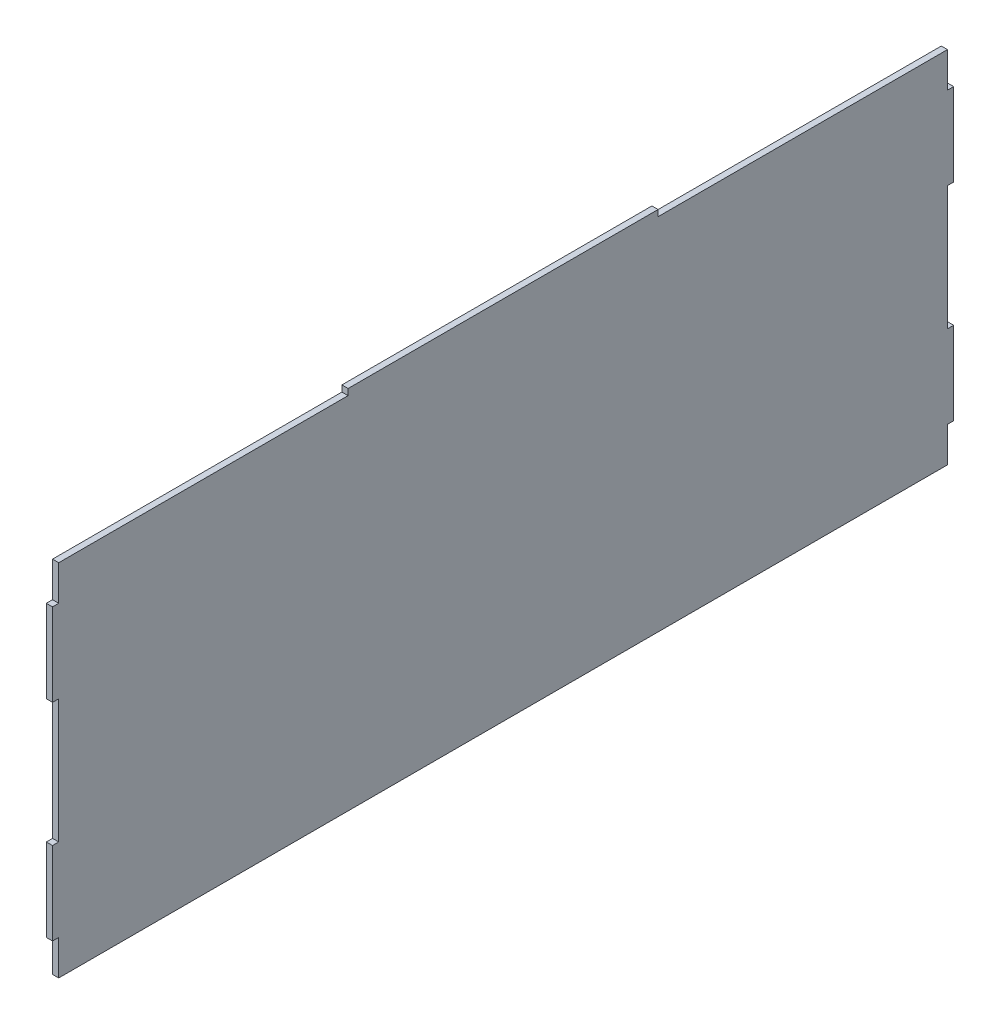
from build123d import *

# Parameters (mm, degrees)
SKETCH1_W             = 6
SKETCH1_H             = 34
BOSS_EXTRUDE1_DEPTH   = 860
SKETCH1_H_2           = 120
BOSS_EXTRUDE1_2_DEPTH = 860
BOSS_EXTRUDE1_3_DEPTH = 860
BOSS_EXTRUDE2_DEPTH   = 6
SKETCH3_W             = 300
SKETCH3_H             = 12
BOSS_EXTRUDE3_DEPTH   = 6


with BuildPart() as part:
    # Sketch1 → Boss-Extrude1 (new body)
    with BuildSketch(Plane.XY):
        with Locations((1314.415843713, 397.51097468)):
            Rectangle(SKETCH1_W, SKETCH1_H)
    extrude(amount=BOSS_EXTRUDE1_DEPTH)



with BuildPart() as body_2:
    # Sketch1 → Boss-Extrude1 2 (new body)
    with BuildSketch(Plane.XY):
        with Locations((1314.415843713, 240.51097468)):
            Rectangle(SKETCH1_W, SKETCH1_H_2)
    extrude(amount=BOSS_EXTRUDE1_2_DEPTH)


with BuildPart() as body_3:
    # Sketch1 → Boss-Extrude1 3 (new body)
    with BuildSketch(Plane.XY):
        with Locations((1314.415843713, 83.51097468)):
            Rectangle(SKETCH1_W, SKETCH1_H)
    extrude(amount=BOSS_EXTRUDE1_3_DEPTH)


with BuildPart() as part_1:
    add(part.part)

    add(body_2.part)  # Boss-Extrude2 merges body 2

    add(body_3.part)  # Boss-Extrude2 merges body 3
    # Sketch2 → Boss-Extrude2 (add)
    with BuildSketch(Plane.ZY.offset(-1311.415843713)):
        Polygon((0, 300.51097468), (0, 180.51097468), (-6, 180.51097468), (-6, 100.51097468), (0, 100.51097468), (0, 66.51097468), (860, 66.51097468), (860, 100.51097468), (866, 100.51097468), (866, 180.51097468), (860, 180.51097468), (860, 300.51097468), (866, 300.51097468), (866, 380.51097468), (860, 380.51097468), (860, 414.51097468), (0, 414.51097468), (0, 380.51097468), (-6, 380.51097468), (-6, 300.51097468), align=None)
    extrude(amount=-BOSS_EXTRUDE2_DEPTH)

    # Sketch3 → Boss-Extrude3 (add)
    with BuildSketch(Plane.ZY.offset(-1311.415843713)):
        with Locations((430, 414.51097468)):
            Rectangle(SKETCH3_W, SKETCH3_H)
    extrude(amount=-BOSS_EXTRUDE3_DEPTH)


solid = part_1.part
